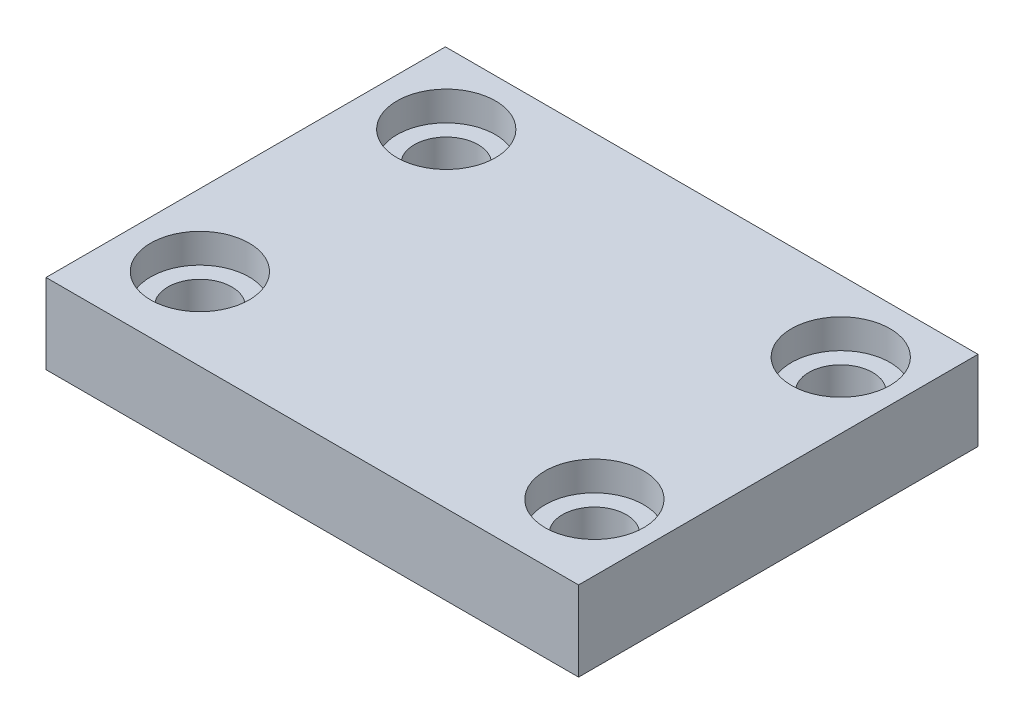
from build123d import *

# Parameters (mm, degrees)
SKETCH1_W                        = 100
SKETCH1_H                        = 75
EXTRUDE1_DEPTH                   = 15
CBORE_FOR_M10_SBHCS1_D           = 12
CBORE_FOR_M10_SBHCS1_CBORE_D     = 18.5
CBORE_FOR_M10_SBHCS1_CBORE_DEPTH = 5.5


with BuildPart() as part:
    # Sketch1 → Extrude1 (new body)
    with BuildSketch(Plane(origin=(0, 0, 0), x_dir=(1, 0, 0), z_dir=(0, 1, 0))):
        Rectangle(SKETCH1_W, SKETCH1_H)
    extrude(amount=EXTRUDE1_DEPTH)

    # CBORE for M10 SBHCS1 (through all)
    with Locations(Plane(origin=(0, 15, 0), x_dir=(-1, 0, 0), z_dir=(0, 1, 0))):
        with Locations((36.516436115, 22.088353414), (36.516436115, -24.170757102), (-37.557637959, -24.170757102), (-37.557637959, 22.088353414)):
            CounterBoreHole(CBORE_FOR_M10_SBHCS1_D / 2, CBORE_FOR_M10_SBHCS1_CBORE_D / 2, CBORE_FOR_M10_SBHCS1_CBORE_DEPTH)


solid = part.part
